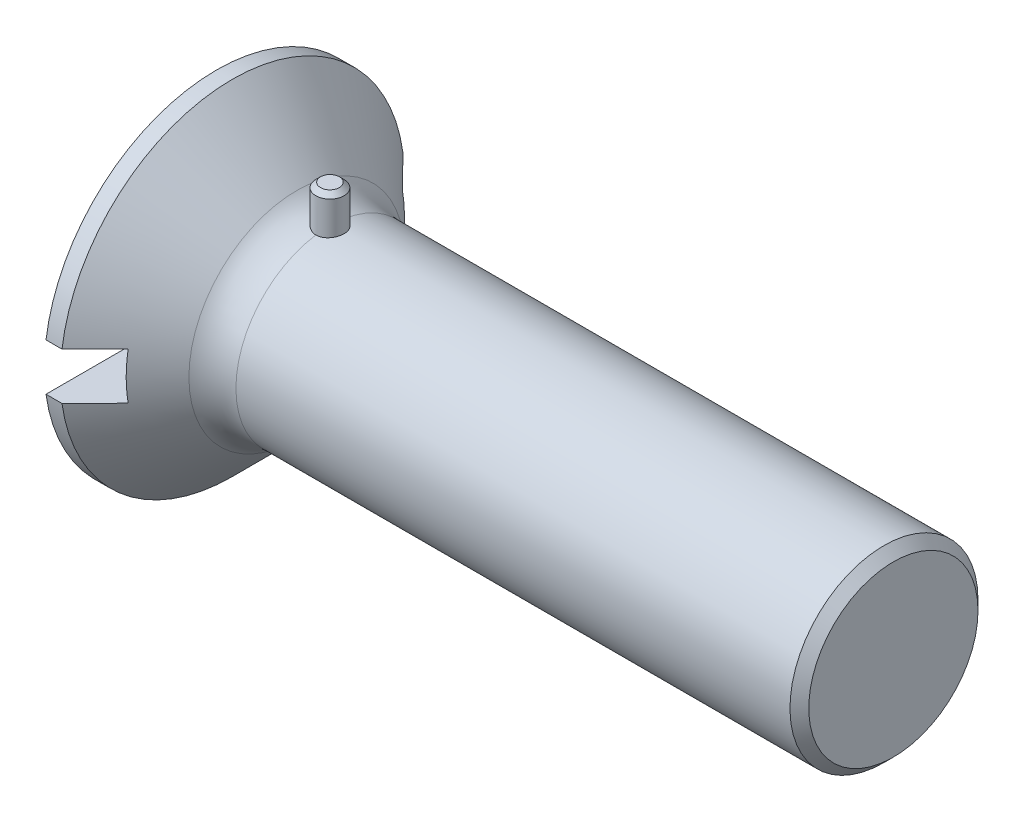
ISO-10303-21;
HEADER;
FILE_DESCRIPTION(('STEP AP214'),'2;1');
FILE_NAME('part.step','',(''),(''),'','','');
FILE_SCHEMA(('AUTOMOTIVE_DESIGN { 1 0 10303 214 1 1 1 1 }'));
ENDSEC;
DATA;
#1=APPLICATION_CONTEXT('core data for automotive mechanical design processes');
#2=APPLICATION_PROTOCOL_DEFINITION('international standard','automotive_design',2000,#1);
#3=PRODUCT_CONTEXT('',#1,'mechanical');
#4=PRODUCT('Part','Part','',(#3));
#5=PRODUCT_RELATED_PRODUCT_CATEGORY('part','',(#4));
#6=PRODUCT_DEFINITION_FORMATION('','',#4);
#7=PRODUCT_DEFINITION_CONTEXT('part definition',#1,'design');
#8=PRODUCT_DEFINITION('design','',#6,#7);
#9=PRODUCT_DEFINITION_SHAPE('','',#8);
#10=(LENGTH_UNIT() NAMED_UNIT(*) SI_UNIT(.MILLI.,.METRE.));
#11=(NAMED_UNIT(*) PLANE_ANGLE_UNIT() SI_UNIT($,.RADIAN.));
#12=(NAMED_UNIT(*) SI_UNIT($,.STERADIAN.) SOLID_ANGLE_UNIT());
#13=UNCERTAINTY_MEASURE_WITH_UNIT(LENGTH_MEASURE(1.E-05),#10,'distance_accuracy_value','');
#14=(GEOMETRIC_REPRESENTATION_CONTEXT(3) GLOBAL_UNCERTAINTY_ASSIGNED_CONTEXT((#13)) GLOBAL_UNIT_ASSIGNED_CONTEXT((#10,
#11,#12)) REPRESENTATION_CONTEXT('',''));
#15=CARTESIAN_POINT('',(0.,0.,0.));
#16=DIRECTION('',(0.,0.,1.));
#17=DIRECTION('',(1.,0.,0.));
#18=AXIS2_PLACEMENT_3D('',#15,#16,#17);
#19=CARTESIAN_POINT('',(-6.34999999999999,0.,0.));
#20=DIRECTION('',(-1.,0.,0.));
#21=DIRECTION('',(0.,0.,1.));
#22=AXIS2_PLACEMENT_3D('',#19,#20,#21);
#23=CYLINDRICAL_SURFACE('',#22,5.);
#24=CARTESIAN_POINT('',(35.5,0.,0.));
#25=DIRECTION('',(1.,0.,0.));
#26=DIRECTION('',(0.,0.,-1.));
#27=AXIS2_PLACEMENT_3D('',#24,#25,#26);
#28=CIRCLE('',#27,5.);
#29=CARTESIAN_POINT('',(35.5,0.,-5.00000000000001));
#30=VERTEX_POINT('',#29);
#31=EDGE_CURVE('E103',#30,#30,#28,.F.);
#32=ORIENTED_EDGE('',*,*,#31,.T.);
#33=EDGE_LOOP('',(#32));
#34=FACE_BOUND('',#33,.T.);
#35=CARTESIAN_POINT('',(6.03553390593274,0.,0.));
#36=DIRECTION('',(-1.,0.,0.));
#37=DIRECTION('',(0.,0.,1.));
#38=AXIS2_PLACEMENT_3D('',#35,#36,#37);
#39=CIRCLE('',#38,5.);
#40=CARTESIAN_POINT('',(6.03553390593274,4.94342998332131,0.750000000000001));
#41=VERTEX_POINT('',#40);
#42=CARTESIAN_POINT('',(6.03553390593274,4.94342998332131,-0.750000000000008));
#43=VERTEX_POINT('',#42);
#44=EDGE_CURVE('E86',#41,#43,#39,.F.);
#45=ORIENTED_EDGE('',*,*,#44,.T.);
#46=CARTESIAN_POINT('',(6.03553390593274,4.94342998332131,-0.750000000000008));
#47=CARTESIAN_POINT('',(6.07740669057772,4.94343068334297,-0.749998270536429));
#48=CARTESIAN_POINT('',(6.1193037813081,4.9439677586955,-0.74648148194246));
#49=CARTESIAN_POINT('',(6.20192656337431,4.9460565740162,-0.732510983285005));
#50=CARTESIAN_POINT('',(6.24265107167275,4.94760930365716,-0.722050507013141));
#51=CARTESIAN_POINT('',(6.32172078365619,4.95154969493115,-0.69451263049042));
#52=CARTESIAN_POINT('',(6.36006778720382,4.95393671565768,-0.677440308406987));
#53=CARTESIAN_POINT('',(6.43334742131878,4.95927597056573,-0.637175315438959));
#54=CARTESIAN_POINT('',(6.46828052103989,4.96222812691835,-0.613983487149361));
#55=CARTESIAN_POINT('',(6.53402581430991,4.96839144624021,-0.561939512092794));
#56=CARTESIAN_POINT('',(6.56480671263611,4.97160431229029,-0.533048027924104));
#57=CARTESIAN_POINT('',(6.62110264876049,4.97791184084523,-0.470509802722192));
#58=CARTESIAN_POINT('',(6.64661739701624,4.98100649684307,-0.436862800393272));
#59=CARTESIAN_POINT('',(6.69177222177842,4.98674673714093,-0.365568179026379));
#60=CARTESIAN_POINT('',(6.71138348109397,4.98939009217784,-0.327902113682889));
#61=CARTESIAN_POINT('',(6.74398970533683,4.99391103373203,-0.24976442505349));
#62=CARTESIAN_POINT('',(6.75698501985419,4.99578866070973,-0.20929295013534));
#63=CARTESIAN_POINT('',(6.77589560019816,4.99855457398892,-0.127015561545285));
#64=CARTESIAN_POINT('',(6.78186326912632,4.99945017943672,-0.0852219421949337));
#65=CARTESIAN_POINT('',(6.78671187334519,5.00017622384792,-0.00121760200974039));
#66=CARTESIAN_POINT('',(6.78559320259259,5.00000672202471,0.040993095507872));
#67=CARTESIAN_POINT('',(6.77634223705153,4.99862749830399,0.124275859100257));
#68=CARTESIAN_POINT('',(6.768266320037,4.9974261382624,0.1653543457));
#69=CARTESIAN_POINT('',(6.74541860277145,4.99412750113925,0.245566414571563));
#70=CARTESIAN_POINT('',(6.73064663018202,4.9920302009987,0.284699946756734));
#71=CARTESIAN_POINT('',(6.69476840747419,4.98716096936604,0.360081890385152));
#72=CARTESIAN_POINT('',(6.67363842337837,4.98438651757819,0.396318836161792));
#73=CARTESIAN_POINT('',(6.62566130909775,4.97847219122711,0.464753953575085));
#74=CARTESIAN_POINT('',(6.59881380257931,4.97533229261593,0.496951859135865));
#75=CARTESIAN_POINT('',(6.53984968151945,4.96900079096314,0.55672724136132));
#76=CARTESIAN_POINT('',(6.50768384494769,4.96580898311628,0.58425616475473));
#77=CARTESIAN_POINT('',(6.43916336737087,4.95976352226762,0.633532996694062));
#78=CARTESIAN_POINT('',(6.40280870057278,4.95690987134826,0.655280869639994));
#79=CARTESIAN_POINT('',(6.32689192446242,4.9518638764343,0.692384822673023));
#80=CARTESIAN_POINT('',(6.28732733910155,4.94967204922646,0.707735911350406));
#81=CARTESIAN_POINT('',(6.20614127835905,4.9462070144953,0.731561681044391));
#82=CARTESIAN_POINT('',(6.16451994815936,4.94493374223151,0.740036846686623));
#83=CARTESIAN_POINT('',(6.080833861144,4.94346225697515,0.749803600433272));
#84=CARTESIAN_POINT('',(6.03877731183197,4.94325374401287,0.751164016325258));
#85=CARTESIAN_POINT('',(5.95503680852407,4.94390803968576,0.746845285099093));
#86=CARTESIAN_POINT('',(5.91335284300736,4.9447708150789,0.741166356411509));
#87=CARTESIAN_POINT('',(5.83175399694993,4.94746101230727,0.722988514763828));
#88=CARTESIAN_POINT('',(5.79183130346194,4.94928358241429,0.7105238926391));
#89=CARTESIAN_POINT('',(5.71464185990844,4.95368400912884,0.679164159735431));
#90=CARTESIAN_POINT('',(5.67737524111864,4.95626190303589,0.660268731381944));
#91=CARTESIAN_POINT('',(5.60624727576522,4.96190677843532,0.616418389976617));
#92=CARTESIAN_POINT('',(5.57241368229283,4.96497729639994,0.591418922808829));
#93=CARTESIAN_POINT('',(5.50939747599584,4.97125079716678,0.536132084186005));
#94=CARTESIAN_POINT('',(5.48021512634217,4.97445378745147,0.505844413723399));
#95=CARTESIAN_POINT('',(5.42708260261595,4.98066352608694,0.440537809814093));
#96=CARTESIAN_POINT('',(5.4031780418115,4.98366841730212,0.405481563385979));
#97=CARTESIAN_POINT('',(5.36159745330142,4.98911452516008,0.33181104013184));
#98=CARTESIAN_POINT('',(5.34392125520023,4.99155575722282,0.293196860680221));
#99=CARTESIAN_POINT('',(5.31537203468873,4.99559134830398,0.213648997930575));
#100=CARTESIAN_POINT('',(5.30447407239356,4.99718880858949,0.172724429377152));
#101=CARTESIAN_POINT('',(5.28970996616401,4.99936988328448,0.0896004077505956));
#102=CARTESIAN_POINT('',(5.28584335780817,4.99995356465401,0.0474010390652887));
#103=CARTESIAN_POINT('',(5.28526305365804,5.00004064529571,-0.0366322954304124));
#104=CARTESIAN_POINT('',(5.28847956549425,4.99955458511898,-0.0784657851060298));
#105=CARTESIAN_POINT('',(5.30182460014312,4.99757805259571,-0.160989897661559));
#106=CARTESIAN_POINT('',(5.31195310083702,4.99608758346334,-0.201680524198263));
#107=CARTESIAN_POINT('',(5.33880984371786,4.99226893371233,-0.280744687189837));
#108=CARTESIAN_POINT('',(5.35553325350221,4.98994136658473,-0.319119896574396));
#109=CARTESIAN_POINT('',(5.39509764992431,4.9847041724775,-0.392530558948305));
#110=CARTESIAN_POINT('',(5.41793883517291,4.9817945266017,-0.427565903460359));
#111=CARTESIAN_POINT('',(5.46934275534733,4.9756825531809,-0.493656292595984));
#112=CARTESIAN_POINT('',(5.49795701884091,4.97247774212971,-0.524671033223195));
#113=CARTESIAN_POINT('',(5.55998644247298,4.966155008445,-0.581484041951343));
#114=CARTESIAN_POINT('',(5.59340272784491,4.96303710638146,-0.607281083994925));
#115=CARTESIAN_POINT('',(5.66430839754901,4.95722242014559,-0.653056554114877));
#116=CARTESIAN_POINT('',(5.70181961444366,4.95452810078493,-0.673001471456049));
#117=CARTESIAN_POINT('',(5.77968229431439,4.94989454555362,-0.706278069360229));
#118=CARTESIAN_POINT('',(5.82003075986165,4.94795452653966,-0.719616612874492));
#119=CARTESIAN_POINT('',(5.88972262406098,4.94549742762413,-0.736274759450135));
#120=CARTESIAN_POINT('',(5.91863560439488,4.9447262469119,-0.741413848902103));
#121=CARTESIAN_POINT('',(5.97687305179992,4.94369228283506,-0.748277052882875));
#122=CARTESIAN_POINT('',(6.00619751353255,4.94342949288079,-0.750001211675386));
#123=CARTESIAN_POINT('',(6.03553390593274,4.94342998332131,-0.750000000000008));
#124=B_SPLINE_CURVE_WITH_KNOTS('',3,(#46,#47,#48,#49,#50,#51,#52,#53,#54,#55,#56,#57,#58,#59,
#60,#61,#62,#63,#64,#65,#66,#67,#68,#69,#70,#71,#72,#73,#74,#75,#76,#77,#78,#79,#80,#81,#82,#83,
#84,#85,#86,#87,#88,#89,#90,#91,#92,#93,#94,#95,#96,#97,#98,#99,#100,#101,#102,#103,#104,#105,
#106,#107,#108,#109,#110,#111,#112,#113,#114,#115,#116,#117,#118,#119,#120,#121,#122,#123),
.UNSPECIFIED.,.T.,.F.,(4,2,2,2,2,2,2,2,2,2,2,2,2,2,2,2,2,2,2,2,2,2,2,2,2,2,2,2,2,2,2,2,2,2,2,2,
2,2,4),(0.,0.125511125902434,0.251144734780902,0.376682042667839,0.502202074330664,
0.628620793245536,0.755046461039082,0.88207961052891,1.00910604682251,1.13517916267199,
1.26124526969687,1.38629931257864,1.511356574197,1.63688658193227,1.76242485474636,
1.88919772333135,2.01597137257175,2.14284375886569,2.2697072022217,2.39534107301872,
2.52097104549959,2.64597197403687,2.77097907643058,2.89692743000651,3.02288290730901,
3.14988768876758,3.27688899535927,3.40342020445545,3.52994305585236,3.65522481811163,
3.78050617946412,3.90569591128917,4.03088970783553,4.15725475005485,4.28364945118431,
4.41075439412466,4.53772701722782,4.62566220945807,4.71359626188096),.UNSPECIFIED.);
#125=EDGE_CURVE('E94',#43,#41,#124,.T.);
#126=ORIENTED_EDGE('',*,*,#125,.T.);
#127=EDGE_LOOP('',(#45,#126));
#128=FACE_BOUND('',#127,.T.);
#129=ADVANCED_FACE('F30',(#34,#128),#23,.T.);
#130=CARTESIAN_POINT('',(6.03553390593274,0.,0.));
#131=DIRECTION('',(-1.,0.,0.));
#132=DIRECTION('',(0.,0.,1.));
#133=AXIS2_PLACEMENT_3D('',#130,#131,#132);
#134=TOROIDAL_SURFACE('',#133,7.5,2.5);
#135=CARTESIAN_POINT('',(4.26776695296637,0.,0.));
#136=DIRECTION('',(-1.,0.,0.));
#137=DIRECTION('',(0.,0.,1.));
#138=AXIS2_PLACEMENT_3D('',#135,#136,#137);
#139=CIRCLE('',#138,5.73223304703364);
#140=CARTESIAN_POINT('',(4.26776695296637,0.,5.73223304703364));
#141=VERTEX_POINT('',#140);
#142=EDGE_CURVE('E92',#141,#141,#139,.T.);
#143=ORIENTED_EDGE('',*,*,#142,.F.);
#144=EDGE_LOOP('',(#143));
#145=FACE_BOUND('',#144,.T.);
#146=CARTESIAN_POINT('',(6.03573390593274,4.94342999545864,-0.749999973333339));
#147=CARTESIAN_POINT('',(6.01567414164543,4.94342525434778,-0.750006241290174));
#148=CARTESIAN_POINT('',(5.99562469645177,4.94379186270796,-0.749205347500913));
#149=CARTESIAN_POINT('',(5.95568729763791,4.94524401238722,-0.746006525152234));
#150=CARTESIAN_POINT('',(5.93579928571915,4.94632928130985,-0.74360920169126));
#151=CARTESIAN_POINT('',(5.87676272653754,4.9506135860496,-0.734079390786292));
#152=CARTESIAN_POINT('',(5.83803888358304,4.95484157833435,-0.724608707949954));
#153=CARTESIAN_POINT('',(5.76292800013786,4.96556447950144,-0.699822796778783));
#154=CARTESIAN_POINT('',(5.72653857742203,4.97205703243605,-0.684513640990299));
#155=CARTESIAN_POINT('',(5.65682024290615,4.98663793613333,-0.648549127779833));
#156=CARTESIAN_POINT('',(5.62349432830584,4.99472782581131,-0.627888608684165));
#157=CARTESIAN_POINT('',(5.55889734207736,5.01218174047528,-0.580523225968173));
#158=CARTESIAN_POINT('',(5.52783318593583,5.02159089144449,-0.553553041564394));
#159=CARTESIAN_POINT('',(5.47050069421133,5.04036434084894,-0.494894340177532));
#160=CARTESIAN_POINT('',(5.44423409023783,5.04972862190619,-0.463204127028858));
#161=CARTESIAN_POINT('',(5.39588131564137,5.06791809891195,-0.393977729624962));
#162=CARTESIAN_POINT('',(5.37408718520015,5.07668914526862,-0.356221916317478));
#163=CARTESIAN_POINT('',(5.33725396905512,5.09204207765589,-0.277136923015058));
#164=CARTESIAN_POINT('',(5.3222112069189,5.09862515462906,-0.235809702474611));
#165=CARTESIAN_POINT('',(5.30014523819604,5.10844560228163,-0.153087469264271));
#166=CARTESIAN_POINT('',(5.2927343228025,5.11184383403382,-0.111815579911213));
#167=CARTESIAN_POINT('',(5.28490917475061,5.11543490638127,-0.0284834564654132));
#168=CARTESIAN_POINT('',(5.2844913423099,5.11562939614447,0.0135763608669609));
#169=CARTESIAN_POINT('',(5.29042570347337,5.11290197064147,0.0938609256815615));
#170=CARTESIAN_POINT('',(5.29626360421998,5.11021678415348,0.132133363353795));
#171=CARTESIAN_POINT('',(5.31366483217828,5.10240738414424,0.207088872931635));
#172=CARTESIAN_POINT('',(5.32522885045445,5.09728287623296,0.243771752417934));
#173=CARTESIAN_POINT('',(5.35393210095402,5.08502564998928,0.315330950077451));
#174=CARTESIAN_POINT('',(5.3711714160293,5.07785721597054,0.350160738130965));
#175=CARTESIAN_POINT('',(5.41065244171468,5.06227136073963,0.41655304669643));
#176=CARTESIAN_POINT('',(5.43289623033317,5.05385342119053,0.448114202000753));
#177=CARTESIAN_POINT('',(5.48396606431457,5.03580799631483,0.509915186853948));
#178=CARTESIAN_POINT('',(5.51319136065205,5.02613855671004,0.53981354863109));
#179=CARTESIAN_POINT('',(5.57629390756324,5.00725135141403,0.594424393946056));
#180=CARTESIAN_POINT('',(5.6101732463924,4.99803379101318,0.619134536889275));
#181=CARTESIAN_POINT('',(5.68304216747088,4.98075755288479,0.663420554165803));
#182=CARTESIAN_POINT('',(5.72216389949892,4.97274740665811,0.682799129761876));
#183=CARTESIAN_POINT('',(5.80353363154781,4.95926930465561,0.714545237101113));
#184=CARTESIAN_POINT('',(5.84577605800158,4.95379693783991,0.726924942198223));
#185=CARTESIAN_POINT('',(5.91298761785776,4.94780989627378,0.740330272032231));
#186=CARTESIAN_POINT('',(5.93736625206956,4.94617319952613,0.743955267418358));
#187=CARTESIAN_POINT('',(5.98640240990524,4.94397873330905,0.748794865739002));
#188=CARTESIAN_POINT('',(6.01105985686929,4.94342067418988,0.750010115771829));
#189=CARTESIAN_POINT('',(6.03573390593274,4.94342999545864,0.749999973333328));
#190=B_SPLINE_CURVE_WITH_KNOTS('',3,(#146,#147,#148,#149,#150,#151,#152,#153,#154,#155,#156,
#157,#158,#159,#160,#161,#162,#163,#164,#165,#166,#167,#168,#169,#170,#171,#172,#173,#174,#175,
#176,#177,#178,#179,#180,#181,#182,#183,#184,#185,#186,#187,#188,#189),.UNSPECIFIED.,.F.,.F.,(4,
2,2,2,2,2,2,2,2,2,2,2,2,2,2,2,2,2,2,2,2,4),(0.,0.0601392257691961,0.120255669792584,
0.23988857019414,0.359397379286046,0.479021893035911,0.605080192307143,0.731183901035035,
0.863911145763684,0.996566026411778,1.12208827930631,1.24754591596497,1.36342791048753,
1.47932389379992,1.59738420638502,1.71549363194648,1.84366222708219,1.97188852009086,
2.10436443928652,2.23660922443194,2.31058258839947,2.38453608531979),.UNSPECIFIED.);
#191=EDGE_CURVE('E44',#43,#41,#190,.T.);
#192=ORIENTED_EDGE('',*,*,#191,.F.);
#193=ORIENTED_EDGE('',*,*,#44,.F.);
#194=EDGE_LOOP('',(#192,#193));
#195=FACE_BOUND('',#194,.T.);
#196=ADVANCED_FACE('F88',(#145,#195),#134,.F.);
#197=CARTESIAN_POINT('',(-6.34999999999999,0.,0.));
#198=DIRECTION('',(-1.,0.,0.));
#199=DIRECTION('',(0.,0.,1.));
#200=AXIS2_PLACEMENT_3D('',#197,#198,#199);
#201=CYLINDRICAL_SURFACE('',#200,9.15);
#202=DIRECTION('',(-1.,0.,0.));
#203=VECTOR('',#202,1.);
#204=CARTESIAN_POINT('',(-6.34999999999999,1.25000000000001,-9.06421535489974));
#205=LINE('',#204,#203);
#206=CARTESIAN_POINT('',(0.,1.25000000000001,-9.06421535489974));
#207=VERTEX_POINT('',#206);
#208=CARTESIAN_POINT('',(0.850000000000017,1.25000000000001,-9.06421535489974));
#209=VERTEX_POINT('',#208);
#210=EDGE_CURVE('E154',#207,#209,#205,.F.);
#211=ORIENTED_EDGE('',*,*,#210,.F.);
#212=CARTESIAN_POINT('',(0.,0.,0.));
#213=DIRECTION('',(-1.,0.,0.));
#214=DIRECTION('',(0.,0.,1.));
#215=AXIS2_PLACEMENT_3D('',#212,#213,#214);
#216=CIRCLE('',#215,9.15);
#217=CARTESIAN_POINT('',(0.,1.25000000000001,9.06421535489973));
#218=VERTEX_POINT('',#217);
#219=EDGE_CURVE('E197',#218,#207,#216,.T.);
#220=ORIENTED_EDGE('',*,*,#219,.F.);
#221=DIRECTION('',(-1.,0.,0.));
#222=VECTOR('',#221,1.);
#223=CARTESIAN_POINT('',(-6.34999999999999,1.25000000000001,9.06421535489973));
#224=LINE('',#223,#222);
#225=CARTESIAN_POINT('',(0.850000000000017,1.25000000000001,9.06421535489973));
#226=VERTEX_POINT('',#225);
#227=EDGE_CURVE('E155',#226,#218,#224,.T.);
#228=ORIENTED_EDGE('',*,*,#227,.F.);
#229=CARTESIAN_POINT('',(0.850000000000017,0.,0.));
#230=DIRECTION('',(-1.,0.,0.));
#231=DIRECTION('',(0.,0.,1.));
#232=AXIS2_PLACEMENT_3D('',#229,#230,#231);
#233=CIRCLE('',#232,9.15);
#234=EDGE_CURVE('E189',#226,#209,#233,.T.);
#235=ORIENTED_EDGE('',*,*,#234,.T.);
#236=EDGE_LOOP('',(#211,#220,#228,#235));
#237=FACE_BOUND('',#236,.T.);
#238=ADVANCED_FACE('F214',(#237),#201,.T.);
#239=CARTESIAN_POINT('',(0.,0.,0.));
#240=DIRECTION('',(-1.,0.,0.));
#241=DIRECTION('',(0.,0.,1.));
#242=AXIS2_PLACEMENT_3D('',#239,#240,#241);
#243=PLANE('',#242);
#244=DIRECTION('',(0.,0.,-1.));
#245=VECTOR('',#244,1.);
#246=CARTESIAN_POINT('',(0.,1.25000000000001,0.));
#247=LINE('',#246,#245);
#248=EDGE_CURVE('E201',#218,#207,#247,.T.);
#249=ORIENTED_EDGE('',*,*,#248,.F.);
#250=ORIENTED_EDGE('',*,*,#219,.T.);
#251=EDGE_LOOP('',(#249,#250));
#252=FACE_BOUND('',#251,.T.);
#253=ADVANCED_FACE('F213',(#252),#243,.T.);
#254=CARTESIAN_POINT('',(36.,5.00000000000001,0.));
#255=DIRECTION('',(1.,0.,0.));
#256=DIRECTION('',(0.,0.,-1.));
#257=AXIS2_PLACEMENT_3D('',#254,#255,#256);
#258=PLANE('',#257);
#259=CARTESIAN_POINT('',(36.,0.,0.));
#260=DIRECTION('',(1.,0.,0.));
#261=DIRECTION('',(0.,0.,-1.));
#262=AXIS2_PLACEMENT_3D('',#259,#260,#261);
#263=CIRCLE('',#262,4.5);
#264=CARTESIAN_POINT('',(36.,0.,-4.5));
#265=VERTEX_POINT('',#264);
#266=EDGE_CURVE('E99',#265,#265,#263,.T.);
#267=ORIENTED_EDGE('',*,*,#266,.T.);
#268=EDGE_LOOP('',(#267));
#269=FACE_BOUND('',#268,.T.);
#270=ADVANCED_FACE('F32',(#269),#258,.T.);
#271=CARTESIAN_POINT('',(0.850000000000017,0.,0.));
#272=DIRECTION('',(-1.,0.,0.));
#273=DIRECTION('',(0.,0.,1.));
#274=AXIS2_PLACEMENT_3D('',#271,#272,#273);
#275=CONICAL_SURFACE('',#274,9.15,0.78539816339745);
#276=CARTESIAN_POINT('',(-10.1802906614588,1.25,-20.141539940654));
#277=CARTESIAN_POINT('',(-9.49733492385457,1.25,-19.4572604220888));
#278=CARTESIAN_POINT('',(-8.81443675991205,1.25,-18.7729234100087));
#279=CARTESIAN_POINT('',(-7.4488164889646,1.24999999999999,-17.4040518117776));
#280=CARTESIAN_POINT('',(-6.76609438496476,1.25,-16.7195172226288));
#281=CARTESIAN_POINT('',(-5.40066563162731,1.25,-15.3499456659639));
#282=CARTESIAN_POINT('',(-4.71795907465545,1.25,-14.6649086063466));
#283=CARTESIAN_POINT('',(-3.35294991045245,1.25,-13.2944535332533));
#284=CARTESIAN_POINT('',(-2.67064729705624,1.25,-12.6090355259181));
#285=CARTESIAN_POINT('',(-1.28106505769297,1.25,-11.2118490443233));
#286=CARTESIAN_POINT('',(-0.573809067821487,1.25,-10.500057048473));
#287=CARTESIAN_POINT('',(0.486181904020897,1.25,-9.43144842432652));
#288=CARTESIAN_POINT('',(0.839372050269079,1.25,-9.07508335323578));
#289=CARTESIAN_POINT('',(1.54531559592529,1.25,-8.3619241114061));
#290=CARTESIAN_POINT('',(1.89806899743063,1.25,-8.00512994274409));
#291=CARTESIAN_POINT('',(2.60285614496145,1.25,-7.29099118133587));
#292=CARTESIAN_POINT('',(2.95489003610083,1.25,-6.93364673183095));
#293=CARTESIAN_POINT('',(3.65797793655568,1.25,-6.21798069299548));
#294=CARTESIAN_POINT('',(4.00903192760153,1.25,-5.85965908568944));
#295=CARTESIAN_POINT('',(4.53433177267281,1.25,-5.32095663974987));
#296=CARTESIAN_POINT('',(4.70921082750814,1.25,-5.14119344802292));
#297=CARTESIAN_POINT('',(5.05838921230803,1.25,-4.78110512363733));
#298=CARTESIAN_POINT('',(5.23268854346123,1.25,-4.60077999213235));
#299=CARTESIAN_POINT('',(5.58047277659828,1.25,-4.23935603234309));
#300=CARTESIAN_POINT('',(5.75395770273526,1.24999999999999,-4.05825722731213));
#301=CARTESIAN_POINT('',(6.09975055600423,1.25,-3.6949401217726));
#302=CARTESIAN_POINT('',(6.27205849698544,1.25000000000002,-3.51272183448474));
#303=CARTESIAN_POINT('',(6.48946168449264,1.25000000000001,-3.2804985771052));
#304=CARTESIAN_POINT('',(6.53540679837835,1.25,-3.23128915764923));
#305=CARTESIAN_POINT('',(6.62714407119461,1.25,-3.13272770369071));
#306=CARTESIAN_POINT('',(6.67293622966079,1.25,-3.08337566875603));
#307=CARTESIAN_POINT('',(6.81005401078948,1.25,-2.93507725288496));
#308=CARTESIAN_POINT('',(6.90111964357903,1.25,-2.83588994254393));
#309=CARTESIAN_POINT('',(7.08200701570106,1.25,-2.63702197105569));
#310=CARTESIAN_POINT('',(7.17183199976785,1.25,-2.53734426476));
#311=CARTESIAN_POINT('',(7.35021853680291,1.25,-2.33686647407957));
#312=CARTESIAN_POINT('',(7.43878013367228,1.25000000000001,-2.23606642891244));
#313=CARTESIAN_POINT('',(7.58408737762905,1.25000000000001,-2.0676719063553));
#314=CARTESIAN_POINT('',(7.64134711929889,1.25,-2.00052159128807));
#315=CARTESIAN_POINT('',(7.75484336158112,1.25,-1.86536279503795));
#316=CARTESIAN_POINT('',(7.81107989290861,1.25,-1.79735433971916));
#317=CARTESIAN_POINT('',(7.92255847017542,1.25,-1.65978923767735));
#318=CARTESIAN_POINT('',(7.97779167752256,1.25,-1.59022540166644));
#319=CARTESIAN_POINT('',(8.08637102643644,1.25,-1.44964552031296));
#320=CARTESIAN_POINT('',(8.13971739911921,1.25000000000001,-1.3786296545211));
#321=CARTESIAN_POINT('',(8.24449265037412,1.25000000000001,-1.23363711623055));
#322=CARTESIAN_POINT('',(8.29588343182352,1.25,-1.15963268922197));
#323=CARTESIAN_POINT('',(8.394689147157,1.25,-1.00884831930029));
#324=CARTESIAN_POINT('',(8.44209937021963,1.25,-0.932065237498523));
#325=CARTESIAN_POINT('',(8.53029022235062,1.25,-0.775689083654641));
#326=CARTESIAN_POINT('',(8.57112999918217,1.25,-0.696129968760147));
#327=CARTESIAN_POINT('',(8.64315315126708,1.25,-0.532779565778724));
#328=CARTESIAN_POINT('',(8.67436411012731,1.25000000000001,-0.449001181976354));
#329=CARTESIAN_POINT('',(8.70975351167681,1.25000000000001,-0.322161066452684));
#330=CARTESIAN_POINT('',(8.71953943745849,1.25,-0.28066511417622));
#331=CARTESIAN_POINT('',(8.73524864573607,1.25,-0.196936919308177));
#332=CARTESIAN_POINT('',(8.74117242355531,1.25,-0.154704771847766));
#333=CARTESIAN_POINT('',(8.74874877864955,1.25,-0.070007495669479));
#334=CARTESIAN_POINT('',(8.75041684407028,1.25,-0.0275437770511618));
#335=CARTESIAN_POINT('',(8.74940568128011,1.25,0.0573331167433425));
#336=CARTESIAN_POINT('',(8.74672624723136,1.25000000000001,0.0997462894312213));
#337=CARTESIAN_POINT('',(8.73724165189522,1.25000000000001,0.18383364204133));
#338=CARTESIAN_POINT('',(8.73046207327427,1.25,0.225510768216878));
#339=CARTESIAN_POINT('',(8.71322400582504,1.25,0.308100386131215));
#340=CARTESIAN_POINT('',(8.70276408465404,1.25,0.349012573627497));
#341=CARTESIAN_POINT('',(8.67864356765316,1.25,0.430106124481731));
#342=CARTESIAN_POINT('',(8.66496623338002,1.25,0.470282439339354));
#343=CARTESIAN_POINT('',(8.63499454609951,1.25,0.549625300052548));
#344=CARTESIAN_POINT('',(8.61870064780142,1.25,0.588792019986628));
#345=CARTESIAN_POINT('',(8.56931218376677,1.25,0.698895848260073));
#346=CARTESIAN_POINT('',(8.53366433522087,1.25,0.76868397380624));
#347=CARTESIAN_POINT('',(8.45749399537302,1.25,0.905570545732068));
#348=CARTESIAN_POINT('',(8.41696607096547,1.25,0.972665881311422));
#349=CARTESIAN_POINT('',(8.33241833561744,1.25,1.10495336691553));
#350=CARTESIAN_POINT('',(8.28838604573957,1.25,1.17013747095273));
#351=CARTESIAN_POINT('',(8.19797580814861,1.25,1.29880016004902));
#352=CARTESIAN_POINT('',(8.15159889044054,1.25,1.36227947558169));
#353=CARTESIAN_POINT('',(8.05664066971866,1.25,1.48858835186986));
#354=CARTESIAN_POINT('',(8.0080415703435,1.25,1.55140446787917));
#355=CARTESIAN_POINT('',(7.90953457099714,1.25,1.67600696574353));
#356=CARTESIAN_POINT('',(7.85962655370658,1.25,1.73779325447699));
#357=CARTESIAN_POINT('',(7.75893568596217,1.25,1.86040030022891));
#358=CARTESIAN_POINT('',(7.70815520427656,1.25,1.92122300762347));
#359=CARTESIAN_POINT('',(7.60582274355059,1.25,2.0422101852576));
#360=CARTESIAN_POINT('',(7.55427079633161,1.25000000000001,2.10237468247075));
#361=CARTESIAN_POINT('',(7.40092829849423,1.25000000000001,2.27950398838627));
#362=CARTESIAN_POINT('',(7.29827574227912,1.25,2.39572204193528));
#363=CARTESIAN_POINT('',(7.0914232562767,1.25,2.62677507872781));
#364=CARTESIAN_POINT('',(6.98722325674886,1.25,2.74160999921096));
#365=CARTESIAN_POINT('',(6.77772262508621,1.25,2.97029860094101));
#366=CARTESIAN_POINT('',(6.67242184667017,1.25,3.08415214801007));
#367=CARTESIAN_POINT('',(6.46102724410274,1.25,3.31112121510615));
#368=CARTESIAN_POINT('',(6.35493341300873,1.25,3.42423672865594));
#369=CARTESIAN_POINT('',(6.03551876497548,1.25,3.7630224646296));
#370=CARTESIAN_POINT('',(5.82131560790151,1.25,3.98786025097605));
#371=CARTESIAN_POINT('',(5.39152152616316,1.25,4.43616676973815));
#372=CARTESIAN_POINT('',(5.17593071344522,1.25,4.65963560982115));
#373=CARTESIAN_POINT('',(4.74606281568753,1.25,5.10336673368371));
#374=CARTESIAN_POINT('',(4.53179525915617,1.25,5.32363825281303));
#375=CARTESIAN_POINT('',(4.10262985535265,1.25,5.76357476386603));
#376=CARTESIAN_POINT('',(3.88773199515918,1.25,5.98323974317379));
#377=CARTESIAN_POINT('',(3.2425833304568,1.25,6.64136905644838));
#378=CARTESIAN_POINT('',(2.81166870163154,1.25,7.07918243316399));
#379=CARTESIAN_POINT('',(1.86373667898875,1.25,8.04012215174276));
#380=CARTESIAN_POINT('',(1.34650578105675,1.25,8.56303761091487));
#381=CARTESIAN_POINT('',(0.311225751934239,1.25,9.60806066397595));
#382=CARTESIAN_POINT('',(-0.206823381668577,1.25,10.1301682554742));
#383=CARTESIAN_POINT('',(-1.76192694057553,1.25,11.6959624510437));
#384=CARTESIAN_POINT('',(-2.79972728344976,1.25,12.7389079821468));
#385=CARTESIAN_POINT('',(-4.89446586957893,1.25,14.8422145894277));
#386=CARTESIAN_POINT('',(-5.95142006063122,1.25,15.9025597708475));
#387=CARTESIAN_POINT('',(-7.53713360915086,1.25,17.4925713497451));
#388=CARTESIAN_POINT('',(-8.06569563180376,1.25,18.0224345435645));
#389=CARTESIAN_POINT('',(-9.12292279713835,1.25,19.0820576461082));
#390=CARTESIAN_POINT('',(-9.65158793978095,1.25000000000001,19.6118175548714));
#391=CARTESIAN_POINT('',(-10.1802906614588,1.25000000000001,20.1415399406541));
#392=B_SPLINE_CURVE_WITH_KNOTS('',3,(#276,#277,#278,#279,#280,#281,#282,#283,#284,#285,#286,
#287,#288,#289,#290,#291,#292,#293,#294,#295,#296,#297,#298,#299,#300,#301,#302,#303,#304,#305,
#306,#307,#308,#309,#310,#311,#312,#313,#314,#315,#316,#317,#318,#319,#320,#321,#322,#323,#324,
#325,#326,#327,#328,#329,#330,#331,#332,#333,#334,#335,#336,#337,#338,#339,#340,#341,#342,#343,
#344,#345,#346,#347,#348,#349,#350,#351,#352,#353,#354,#355,#356,#357,#358,#359,#360,#361,#362,
#363,#364,#365,#366,#367,#368,#369,#370,#371,#372,#373,#374,#375,#376,#377,#378,#379,#380,#381,
#382,#383,#384,#385,#386,#387,#388,#389,#390,#391),.UNSPECIFIED.,.F.,.F.,(4,2,2,2,2,2,2,2,2,2,2,
2,2,2,2,2,2,2,2,2,2,2,2,2,2,2,2,2,2,2,2,2,2,2,2,2,2,2,2,2,2,2,2,2,2,2,2,2,2,2,2,2,2,2,2,2,2,4),
(0.,2.90034535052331,5.80073730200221,8.70216374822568,11.6035447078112,14.6138144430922,
16.1190232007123,17.6242247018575,19.1290847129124,20.6339725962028,21.3863528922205,
22.1387316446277,22.8910879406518,23.6434353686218,23.8454070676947,24.0473793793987,
24.4513296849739,24.8538617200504,25.2563797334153,25.5211185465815,25.7858493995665,
26.0523007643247,26.3187193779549,26.5889298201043,26.859455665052,27.127390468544,
27.3945504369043,27.522300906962,27.6500349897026,27.7773035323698,27.9045781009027,
28.0310666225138,28.157604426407,28.2848156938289,28.4120048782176,28.6467757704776,
28.8818104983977,29.1177232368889,29.3535332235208,29.5917741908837,29.8300365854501,
30.0677310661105,30.3054157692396,30.7705771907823,31.2357596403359,31.7010047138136,
32.1662538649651,33.0978612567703,34.0293944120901,34.951277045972,35.873178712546,
37.7160837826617,39.9225991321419,42.1291209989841,46.5430614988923,51.0345373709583,
53.2797979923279,55.5250577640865),.UNSPECIFIED.);
#393=CARTESIAN_POINT('',(2.6,1.25000000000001,7.29366163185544));
#394=VERTEX_POINT('',#393);
#395=EDGE_CURVE('E148',#394,#226,#392,.T.);
#396=ORIENTED_EDGE('',*,*,#395,.F.);
#397=CARTESIAN_POINT('',(2.6,0.,0.));
#398=DIRECTION('',(1.,0.,0.));
#399=DIRECTION('',(0.,0.,-1.));
#400=AXIS2_PLACEMENT_3D('',#397,#398,#399);
#401=CIRCLE('',#400,7.40000000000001);
#402=CARTESIAN_POINT('',(2.6,-1.25,7.29366163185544));
#403=VERTEX_POINT('',#402);
#404=EDGE_CURVE('E175',#403,#394,#401,.F.);
#405=ORIENTED_EDGE('',*,*,#404,.F.);
#406=CARTESIAN_POINT('',(-10.1802906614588,-1.24999999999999,20.141539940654));
#407=CARTESIAN_POINT('',(-9.49733492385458,-1.25,19.4572604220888));
#408=CARTESIAN_POINT('',(-8.81443675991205,-1.25000000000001,18.7729234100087));
#409=CARTESIAN_POINT('',(-7.44881648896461,-1.25000000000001,17.4040518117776));
#410=CARTESIAN_POINT('',(-6.76609438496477,-1.25000000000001,16.7195172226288));
#411=CARTESIAN_POINT('',(-5.40066563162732,-1.25000000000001,15.3499456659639));
#412=CARTESIAN_POINT('',(-4.71795907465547,-1.25000000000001,14.6649086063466));
#413=CARTESIAN_POINT('',(-3.35294991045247,-1.25000000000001,13.2944535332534));
#414=CARTESIAN_POINT('',(-2.67064729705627,-1.25000000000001,12.6090355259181));
#415=CARTESIAN_POINT('',(-1.28106505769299,-1.25000000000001,11.2118490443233));
#416=CARTESIAN_POINT('',(-0.573809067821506,-1.25000000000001,10.500057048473));
#417=CARTESIAN_POINT('',(0.486181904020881,-1.25000000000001,9.43144842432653));
#418=CARTESIAN_POINT('',(0.839372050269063,-1.25000000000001,9.0750833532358));
#419=CARTESIAN_POINT('',(1.54531559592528,-1.25000000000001,8.36192411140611));
#420=CARTESIAN_POINT('',(1.89806899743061,-1.25000000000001,8.0051299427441));
#421=CARTESIAN_POINT('',(2.60285614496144,-1.25000000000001,7.29099118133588));
#422=CARTESIAN_POINT('',(2.95489003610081,-1.25000000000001,6.93364673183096));
#423=CARTESIAN_POINT('',(3.65797793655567,-1.25000000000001,6.21798069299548));
#424=CARTESIAN_POINT('',(4.00903192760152,-1.25000000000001,5.85965908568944));
#425=CARTESIAN_POINT('',(4.5343317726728,-1.25000000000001,5.32095663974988));
#426=CARTESIAN_POINT('',(4.70921082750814,-1.25000000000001,5.14119344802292));
#427=CARTESIAN_POINT('',(5.05838921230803,-1.25000000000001,4.78110512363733));
#428=CARTESIAN_POINT('',(5.23268854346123,-1.25000000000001,4.60077999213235));
#429=CARTESIAN_POINT('',(5.58047277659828,-1.25000000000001,4.23935603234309));
#430=CARTESIAN_POINT('',(5.75395770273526,-1.25000000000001,4.05825722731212));
#431=CARTESIAN_POINT('',(6.09975055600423,-1.25000000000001,3.6949401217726));
#432=CARTESIAN_POINT('',(6.27205849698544,-1.25000000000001,3.51272183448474));
#433=CARTESIAN_POINT('',(6.48946168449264,-1.25000000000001,3.2804985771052));
#434=CARTESIAN_POINT('',(6.53540679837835,-1.25000000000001,3.23128915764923));
#435=CARTESIAN_POINT('',(6.62714407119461,-1.25000000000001,3.13272770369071));
#436=CARTESIAN_POINT('',(6.67293622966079,-1.25000000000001,3.08337566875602));
#437=CARTESIAN_POINT('',(6.81005401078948,-1.25000000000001,2.93507725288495));
#438=CARTESIAN_POINT('',(6.90111964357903,-1.25000000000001,2.83588994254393));
#439=CARTESIAN_POINT('',(7.08200701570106,-1.25000000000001,2.63702197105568));
#440=CARTESIAN_POINT('',(7.17183199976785,-1.25000000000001,2.53734426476));
#441=CARTESIAN_POINT('',(7.35021853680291,-1.25000000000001,2.33686647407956));
#442=CARTESIAN_POINT('',(7.43878013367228,-1.25000000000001,2.23606642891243));
#443=CARTESIAN_POINT('',(7.58408737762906,-1.25000000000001,2.06767190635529));
#444=CARTESIAN_POINT('',(7.64134711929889,-1.25000000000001,2.00052159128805));
#445=CARTESIAN_POINT('',(7.75484336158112,-1.25000000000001,1.86536279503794));
#446=CARTESIAN_POINT('',(7.81107989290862,-1.25000000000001,1.79735433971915));
#447=CARTESIAN_POINT('',(7.92255847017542,-1.25000000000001,1.65978923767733));
#448=CARTESIAN_POINT('',(7.97779167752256,-1.25000000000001,1.59022540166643));
#449=CARTESIAN_POINT('',(8.08637102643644,-1.25,1.44964552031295));
#450=CARTESIAN_POINT('',(8.13971739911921,-1.24999999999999,1.37862965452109));
#451=CARTESIAN_POINT('',(8.24449265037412,-1.24999999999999,1.23363711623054));
#452=CARTESIAN_POINT('',(8.29588343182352,-1.25,1.15963268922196));
#453=CARTESIAN_POINT('',(8.394689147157,-1.25000000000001,1.00884831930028));
#454=CARTESIAN_POINT('',(8.44209937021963,-1.25000000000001,0.932065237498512));
#455=CARTESIAN_POINT('',(8.53029022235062,-1.25000000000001,0.775689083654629));
#456=CARTESIAN_POINT('',(8.57112999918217,-1.25000000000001,0.696129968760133));
#457=CARTESIAN_POINT('',(8.64315315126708,-1.25,0.532779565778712));
#458=CARTESIAN_POINT('',(8.67436411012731,-1.24999999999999,0.449001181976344));
#459=CARTESIAN_POINT('',(8.70975351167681,-1.25,0.322161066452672));
#460=CARTESIAN_POINT('',(8.71953943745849,-1.25000000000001,0.280665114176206));
#461=CARTESIAN_POINT('',(8.73524864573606,-1.25000000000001,0.196936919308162));
#462=CARTESIAN_POINT('',(8.7411724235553,-1.25000000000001,0.154704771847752));
#463=CARTESIAN_POINT('',(8.74874877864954,-1.25000000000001,0.0700074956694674));
#464=CARTESIAN_POINT('',(8.75041684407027,-1.25000000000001,0.027543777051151));
#465=CARTESIAN_POINT('',(8.74940568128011,-1.25000000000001,-0.0573331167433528));
#466=CARTESIAN_POINT('',(8.74672624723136,-1.25000000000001,-0.0997462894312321));
#467=CARTESIAN_POINT('',(8.73724165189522,-1.25000000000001,-0.18383364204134));
#468=CARTESIAN_POINT('',(8.73046207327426,-1.25000000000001,-0.225510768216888));
#469=CARTESIAN_POINT('',(8.71322400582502,-1.25000000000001,-0.308100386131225));
#470=CARTESIAN_POINT('',(8.70276408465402,-1.25000000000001,-0.349012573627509));
#471=CARTESIAN_POINT('',(8.67864356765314,-1.25000000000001,-0.430106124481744));
#472=CARTESIAN_POINT('',(8.66496623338,-1.25000000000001,-0.470282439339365));
#473=CARTESIAN_POINT('',(8.6349945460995,-1.25000000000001,-0.549625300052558));
#474=CARTESIAN_POINT('',(8.61870064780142,-1.25000000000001,-0.588792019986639));
#475=CARTESIAN_POINT('',(8.56931218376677,-1.25000000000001,-0.698895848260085));
#476=CARTESIAN_POINT('',(8.53366433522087,-1.25000000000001,-0.768683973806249));
#477=CARTESIAN_POINT('',(8.45749399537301,-1.25000000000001,-0.905570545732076));
#478=CARTESIAN_POINT('',(8.41696607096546,-1.25000000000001,-0.972665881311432));
#479=CARTESIAN_POINT('',(8.33241833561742,-1.25000000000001,-1.10495336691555));
#480=CARTESIAN_POINT('',(8.28838604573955,-1.25000000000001,-1.17013747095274));
#481=CARTESIAN_POINT('',(8.19797580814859,-1.25000000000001,-1.29880016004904));
#482=CARTESIAN_POINT('',(8.15159889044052,-1.25000000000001,-1.36227947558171));
#483=CARTESIAN_POINT('',(8.05664066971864,-1.25000000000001,-1.48858835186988));
#484=CARTESIAN_POINT('',(8.00804157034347,-1.25000000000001,-1.55140446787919));
#485=CARTESIAN_POINT('',(7.90953457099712,-1.25000000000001,-1.67600696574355));
#486=CARTESIAN_POINT('',(7.85962655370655,-1.25000000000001,-1.73779325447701));
#487=CARTESIAN_POINT('',(7.75893568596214,-1.25000000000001,-1.86040030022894));
#488=CARTESIAN_POINT('',(7.70815520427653,-1.25000000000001,-1.9212230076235));
#489=CARTESIAN_POINT('',(7.60582274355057,-1.25000000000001,-2.04221018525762));
#490=CARTESIAN_POINT('',(7.55427079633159,-1.25,-2.10237468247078));
#491=CARTESIAN_POINT('',(7.4009282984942,-1.24999999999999,-2.2795039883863));
#492=CARTESIAN_POINT('',(7.29827574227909,-1.25,-2.39572204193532));
#493=CARTESIAN_POINT('',(7.09142325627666,-1.25000000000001,-2.62677507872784));
#494=CARTESIAN_POINT('',(6.98722325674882,-1.25000000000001,-2.741609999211));
#495=CARTESIAN_POINT('',(6.77772262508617,-1.25000000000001,-2.97029860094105));
#496=CARTESIAN_POINT('',(6.67242184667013,-1.25000000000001,-3.08415214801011));
#497=CARTESIAN_POINT('',(6.46102724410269,-1.25000000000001,-3.3111212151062));
#498=CARTESIAN_POINT('',(6.35493341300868,-1.25000000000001,-3.42423672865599));
#499=CARTESIAN_POINT('',(6.03551876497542,-1.25000000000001,-3.76302246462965));
#500=CARTESIAN_POINT('',(5.82131560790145,-1.25000000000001,-3.98786025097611));
#501=CARTESIAN_POINT('',(5.39152152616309,-1.25000000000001,-4.43616676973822));
#502=CARTESIAN_POINT('',(5.17593071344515,-1.25000000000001,-4.65963560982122));
#503=CARTESIAN_POINT('',(4.74606281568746,-1.25000000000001,-5.10336673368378));
#504=CARTESIAN_POINT('',(4.53179525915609,-1.25000000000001,-5.32363825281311));
#505=CARTESIAN_POINT('',(4.10262985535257,-1.25000000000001,-5.76357476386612));
#506=CARTESIAN_POINT('',(3.88773199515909,-1.25000000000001,-5.98323974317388));
#507=CARTESIAN_POINT('',(3.2425833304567,-1.25000000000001,-6.64136905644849));
#508=CARTESIAN_POINT('',(2.81166870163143,-1.25000000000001,-7.07918243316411));
#509=CARTESIAN_POINT('',(1.86373667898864,-1.25000000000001,-8.04012215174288));
#510=CARTESIAN_POINT('',(1.34650578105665,-1.25000000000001,-8.56303761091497));
#511=CARTESIAN_POINT('',(0.311225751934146,-1.25000000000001,-9.60806066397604));
#512=CARTESIAN_POINT('',(-0.206823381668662,-1.25000000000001,-10.1301682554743));
#513=CARTESIAN_POINT('',(-1.7619269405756,-1.25000000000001,-11.6959624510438));
#514=CARTESIAN_POINT('',(-2.79972728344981,-1.25000000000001,-12.7389079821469));
#515=CARTESIAN_POINT('',(-4.89446586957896,-1.25000000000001,-14.8422145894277));
#516=CARTESIAN_POINT('',(-5.95142006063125,-1.25000000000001,-15.9025597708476));
#517=CARTESIAN_POINT('',(-7.53713360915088,-1.25000000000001,-17.4925713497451));
#518=CARTESIAN_POINT('',(-8.06569563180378,-1.25000000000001,-18.0224345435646));
#519=CARTESIAN_POINT('',(-9.12292279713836,-1.25000000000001,-19.0820576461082));
#520=CARTESIAN_POINT('',(-9.65158793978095,-1.25,-19.6118175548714));
#521=CARTESIAN_POINT('',(-10.1802906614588,-1.24999999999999,-20.141539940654));
#522=B_SPLINE_CURVE_WITH_KNOTS('',3,(#406,#407,#408,#409,#410,#411,#412,#413,#414,#415,#416,
#417,#418,#419,#420,#421,#422,#423,#424,#425,#426,#427,#428,#429,#430,#431,#432,#433,#434,#435,
#436,#437,#438,#439,#440,#441,#442,#443,#444,#445,#446,#447,#448,#449,#450,#451,#452,#453,#454,
#455,#456,#457,#458,#459,#460,#461,#462,#463,#464,#465,#466,#467,#468,#469,#470,#471,#472,#473,
#474,#475,#476,#477,#478,#479,#480,#481,#482,#483,#484,#485,#486,#487,#488,#489,#490,#491,#492,
#493,#494,#495,#496,#497,#498,#499,#500,#501,#502,#503,#504,#505,#506,#507,#508,#509,#510,#511,
#512,#513,#514,#515,#516,#517,#518,#519,#520,#521),.UNSPECIFIED.,.F.,.F.,(4,2,2,2,2,2,2,2,2,2,2,
2,2,2,2,2,2,2,2,2,2,2,2,2,2,2,2,2,2,2,2,2,2,2,2,2,2,2,2,2,2,2,2,2,2,2,2,2,2,2,2,2,2,2,2,2,2,4),
(0.,2.9003453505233,5.8007373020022,8.70216374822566,11.6035447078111,14.6138144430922,
16.1190232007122,17.6242247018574,19.1290847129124,20.6339725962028,21.3863528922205,
22.1387316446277,22.8910879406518,23.6434353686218,23.8454070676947,24.0473793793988,
24.451329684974,24.8538617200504,25.2563797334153,25.5211185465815,25.7858493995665,
26.0523007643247,26.3187193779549,26.5889298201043,26.859455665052,27.127390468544,
27.3945504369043,27.5223009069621,27.6500349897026,27.7773035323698,27.9045781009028,
28.0310666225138,28.157604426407,28.2848156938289,28.4120048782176,28.6467757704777,
28.8818104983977,29.1177232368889,29.3535332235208,29.5917741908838,29.8300365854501,
30.0677310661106,30.3054157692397,30.7705771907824,31.235759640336,31.7010047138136,
32.1662538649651,33.0978612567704,34.0293944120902,34.9512770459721,35.8731787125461,
37.7160837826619,39.922599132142,42.1291209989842,46.5430614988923,51.0345373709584,
53.2797979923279,55.5250577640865),.UNSPECIFIED.);
#523=CARTESIAN_POINT('',(0.850000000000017,-1.24999999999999,9.06421535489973));
#524=VERTEX_POINT('',#523);
#525=EDGE_CURVE('E206',#524,#403,#522,.T.);
#526=ORIENTED_EDGE('',*,*,#525,.F.);
#527=CARTESIAN_POINT('',(0.850000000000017,-1.25000000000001,-9.06421535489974));
#528=VERTEX_POINT('',#527);
#529=EDGE_CURVE('E192',#528,#524,#233,.T.);
#530=ORIENTED_EDGE('',*,*,#529,.F.);
#531=CARTESIAN_POINT('',(2.6,-1.25,-7.29366163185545));
#532=VERTEX_POINT('',#531);
#533=EDGE_CURVE('E140',#532,#528,#522,.T.);
#534=ORIENTED_EDGE('',*,*,#533,.F.);
#535=CARTESIAN_POINT('',(2.6,1.25,-7.29366163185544));
#536=VERTEX_POINT('',#535);
#537=EDGE_CURVE('E182',#536,#532,#401,.F.);
#538=ORIENTED_EDGE('',*,*,#537,.F.);
#539=EDGE_CURVE('E156',#209,#536,#392,.T.);
#540=ORIENTED_EDGE('',*,*,#539,.F.);
#541=ORIENTED_EDGE('',*,*,#234,.F.);
#542=EDGE_LOOP('',(#396,#405,#526,#530,#534,#538,#540,#541));
#543=FACE_BOUND('',#542,.T.);
#544=ORIENTED_EDGE('',*,*,#142,.T.);
#545=EDGE_LOOP('',(#544));
#546=FACE_BOUND('',#545,.T.);
#547=ADVANCED_FACE('F132',(#543,#546),#275,.T.);
#548=DIRECTION('',(-1.,0.,0.));
#549=VECTOR('',#548,1.);
#550=CARTESIAN_POINT('',(-6.34999999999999,-1.24999999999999,9.06421535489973));
#551=LINE('',#550,#549);
#552=CARTESIAN_POINT('',(0.,-1.24999999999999,9.06421535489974));
#553=VERTEX_POINT('',#552);
#554=EDGE_CURVE('E208',#553,#524,#551,.F.);
#555=ORIENTED_EDGE('',*,*,#554,.F.);
#556=CARTESIAN_POINT('',(0.,-1.25000000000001,-9.06421535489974));
#557=VERTEX_POINT('',#556);
#558=EDGE_CURVE('E198',#557,#553,#216,.T.);
#559=ORIENTED_EDGE('',*,*,#558,.F.);
#560=DIRECTION('',(-1.,0.,0.));
#561=VECTOR('',#560,1.);
#562=CARTESIAN_POINT('',(-6.34999999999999,-1.25000000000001,-9.06421535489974));
#563=LINE('',#562,#561);
#564=EDGE_CURVE('E52',#528,#557,#563,.T.);
#565=ORIENTED_EDGE('',*,*,#564,.F.);
#566=ORIENTED_EDGE('',*,*,#529,.T.);
#567=EDGE_LOOP('',(#555,#559,#565,#566));
#568=FACE_BOUND('',#567,.T.);
#569=ADVANCED_FACE('F136',(#568),#201,.T.);
#570=DIRECTION('',(0.,0.,1.));
#571=VECTOR('',#570,1.);
#572=CARTESIAN_POINT('',(0.,-1.25,0.));
#573=LINE('',#572,#571);
#574=EDGE_CURVE('E91',#557,#553,#573,.T.);
#575=ORIENTED_EDGE('',*,*,#574,.F.);
#576=ORIENTED_EDGE('',*,*,#558,.T.);
#577=EDGE_LOOP('',(#575,#576));
#578=FACE_BOUND('',#577,.T.);
#579=ADVANCED_FACE('F162',(#578),#243,.T.);
#580=CARTESIAN_POINT('',(2.6,1.25,9.15));
#581=DIRECTION('',(0.,1.,0.));
#582=DIRECTION('',(0.,0.,1.));
#583=AXIS2_PLACEMENT_3D('',#580,#581,#582);
#584=PLANE('',#583);
#585=ORIENTED_EDGE('',*,*,#539,.T.);
#586=DIRECTION('',(0.,0.,-1.));
#587=VECTOR('',#586,1.);
#588=CARTESIAN_POINT('',(2.6,1.25,9.15));
#589=LINE('',#588,#587);
#590=EDGE_CURVE('E96',#394,#536,#589,.T.);
#591=ORIENTED_EDGE('',*,*,#590,.F.);
#592=ORIENTED_EDGE('',*,*,#395,.T.);
#593=ORIENTED_EDGE('',*,*,#227,.T.);
#594=ORIENTED_EDGE('',*,*,#248,.T.);
#595=ORIENTED_EDGE('',*,*,#210,.T.);
#596=EDGE_LOOP('',(#585,#591,#592,#593,#594,#595));
#597=FACE_BOUND('',#596,.T.);
#598=ADVANCED_FACE('F158',(#597),#584,.F.);
#599=CARTESIAN_POINT('',(2.6,-1.25000000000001,-9.15000000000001));
#600=DIRECTION('',(0.,-1.,0.));
#601=DIRECTION('',(0.,0.,-1.));
#602=AXIS2_PLACEMENT_3D('',#599,#600,#601);
#603=PLANE('',#602);
#604=ORIENTED_EDGE('',*,*,#525,.T.);
#605=DIRECTION('',(0.,0.,1.));
#606=VECTOR('',#605,1.);
#607=CARTESIAN_POINT('',(2.6,-1.25000000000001,-9.15000000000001));
#608=LINE('',#607,#606);
#609=EDGE_CURVE('E179',#532,#403,#608,.T.);
#610=ORIENTED_EDGE('',*,*,#609,.F.);
#611=ORIENTED_EDGE('',*,*,#533,.T.);
#612=ORIENTED_EDGE('',*,*,#564,.T.);
#613=ORIENTED_EDGE('',*,*,#574,.T.);
#614=ORIENTED_EDGE('',*,*,#554,.T.);
#615=EDGE_LOOP('',(#604,#610,#611,#612,#613,#614));
#616=FACE_BOUND('',#615,.T.);
#617=ADVANCED_FACE('F161',(#616),#603,.F.);
#618=CARTESIAN_POINT('',(2.6,-1.25000000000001,-9.15000000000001));
#619=DIRECTION('',(1.,0.,0.));
#620=DIRECTION('',(0.,0.,-1.));
#621=AXIS2_PLACEMENT_3D('',#618,#619,#620);
#622=PLANE('',#621);
#623=ORIENTED_EDGE('',*,*,#404,.T.);
#624=ORIENTED_EDGE('',*,*,#590,.T.);
#625=ORIENTED_EDGE('',*,*,#537,.T.);
#626=ORIENTED_EDGE('',*,*,#609,.T.);
#627=EDGE_LOOP('',(#623,#624,#625,#626));
#628=FACE_BOUND('',#627,.T.);
#629=ADVANCED_FACE('F166',(#628),#622,.F.);
#630=CARTESIAN_POINT('',(35.5,0.,0.));
#631=DIRECTION('',(-1.,0.,0.));
#632=DIRECTION('',(0.,0.,1.));
#633=AXIS2_PLACEMENT_3D('',#630,#631,#632);
#634=CONICAL_SURFACE('',#633,5.,0.785398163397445);
#635=ORIENTED_EDGE('',*,*,#266,.F.);
#636=EDGE_LOOP('',(#635));
#637=FACE_BOUND('',#636,.T.);
#638=ORIENTED_EDGE('',*,*,#31,.F.);
#639=EDGE_LOOP('',(#638));
#640=FACE_BOUND('',#639,.T.);
#641=ADVANCED_FACE('F119',(#637,#640),#634,.T.);
#642=CARTESIAN_POINT('',(6.03553390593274,7.00000000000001,0.));
#643=DIRECTION('',(0.,-1.,0.));
#644=DIRECTION('',(0.,0.,-1.));
#645=AXIS2_PLACEMENT_3D('',#642,#643,#644);
#646=CYLINDRICAL_SURFACE('',#645,0.75);
#647=CARTESIAN_POINT('',(6.03553390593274,6.75000000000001,0.));
#648=DIRECTION('',(0.,1.,0.));
#649=DIRECTION('',(0.,0.,1.));
#650=AXIS2_PLACEMENT_3D('',#647,#648,#649);
#651=CIRCLE('',#650,0.75);
#652=CARTESIAN_POINT('',(6.03553390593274,6.75000000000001,0.749999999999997));
#653=VERTEX_POINT('',#652);
#654=EDGE_CURVE('E11',#653,#653,#651,.F.);
#655=ORIENTED_EDGE('',*,*,#654,.T.);
#656=EDGE_LOOP('',(#655));
#657=FACE_BOUND('',#656,.T.);
#658=ORIENTED_EDGE('',*,*,#125,.F.);
#659=ORIENTED_EDGE('',*,*,#191,.T.);
#660=EDGE_LOOP('',(#658,#659));
#661=FACE_BOUND('',#660,.T.);
#662=ADVANCED_FACE('F98',(#657,#661),#646,.T.);
#663=CARTESIAN_POINT('',(6.03553390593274,7.00000000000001,0.));
#664=DIRECTION('',(0.,1.,0.));
#665=DIRECTION('',(0.,0.,1.));
#666=AXIS2_PLACEMENT_3D('',#663,#664,#665);
#667=PLANE('',#666);
#668=CARTESIAN_POINT('',(6.03553390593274,7.00000000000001,0.));
#669=DIRECTION('',(0.,1.,0.));
#670=DIRECTION('',(0.,0.,1.));
#671=AXIS2_PLACEMENT_3D('',#668,#669,#670);
#672=CIRCLE('',#671,0.5);
#673=CARTESIAN_POINT('',(6.03553390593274,7.00000000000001,0.499999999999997));
#674=VERTEX_POINT('',#673);
#675=EDGE_CURVE('E38',#674,#674,#672,.T.);
#676=ORIENTED_EDGE('',*,*,#675,.T.);
#677=EDGE_LOOP('',(#676));
#678=FACE_BOUND('',#677,.T.);
#679=ADVANCED_FACE('F118',(#678),#667,.T.);
#680=CARTESIAN_POINT('',(6.03553390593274,7.00000000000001,0.));
#681=DIRECTION('',(0.,-1.,0.));
#682=DIRECTION('',(0.,0.,-1.));
#683=AXIS2_PLACEMENT_3D('',#680,#681,#682);
#684=CONICAL_SURFACE('',#683,0.5,0.785398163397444);
#685=ORIENTED_EDGE('',*,*,#654,.F.);
#686=EDGE_LOOP('',(#685));
#687=FACE_BOUND('',#686,.T.);
#688=ORIENTED_EDGE('',*,*,#675,.F.);
#689=EDGE_LOOP('',(#688));
#690=FACE_BOUND('',#689,.T.);
#691=ADVANCED_FACE('F244',(#687,#690),#684,.T.);
#692=CLOSED_SHELL('',(#129,#196,#238,#253,#270,#547,#569,#579,#598,#617,#629,#641,#662,#679,#691));
#693=MANIFOLD_SOLID_BREP('B2',#692);
#694=ADVANCED_BREP_SHAPE_REPRESENTATION('',(#18,#693),#14);
#695=SHAPE_DEFINITION_REPRESENTATION(#9,#694);
ENDSEC;
END-ISO-10303-21;
